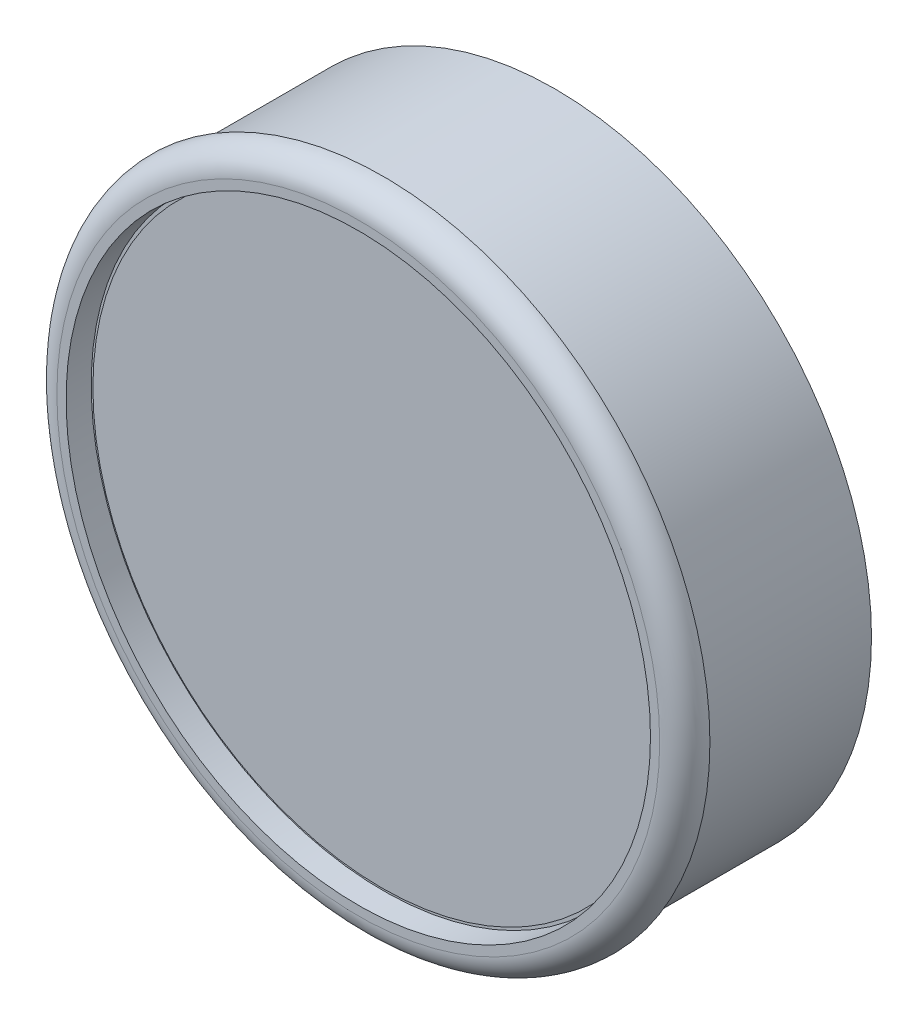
ISO-10303-21;
HEADER;
FILE_DESCRIPTION(('STEP AP214'),'2;1');
FILE_NAME('part.step','',(''),(''),'','','');
FILE_SCHEMA(('AUTOMOTIVE_DESIGN { 1 0 10303 214 1 1 1 1 }'));
ENDSEC;
DATA;
#1=APPLICATION_CONTEXT('core data for automotive mechanical design processes');
#2=APPLICATION_PROTOCOL_DEFINITION('international standard','automotive_design',2000,#1);
#3=PRODUCT_CONTEXT('',#1,'mechanical');
#4=PRODUCT('Part','Part','',(#3));
#5=PRODUCT_RELATED_PRODUCT_CATEGORY('part','',(#4));
#6=PRODUCT_DEFINITION_FORMATION('','',#4);
#7=PRODUCT_DEFINITION_CONTEXT('part definition',#1,'design');
#8=PRODUCT_DEFINITION('design','',#6,#7);
#9=PRODUCT_DEFINITION_SHAPE('','',#8);
#10=(LENGTH_UNIT() NAMED_UNIT(*) SI_UNIT(.MILLI.,.METRE.));
#11=(NAMED_UNIT(*) PLANE_ANGLE_UNIT() SI_UNIT($,.RADIAN.));
#12=(NAMED_UNIT(*) SI_UNIT($,.STERADIAN.) SOLID_ANGLE_UNIT());
#13=UNCERTAINTY_MEASURE_WITH_UNIT(LENGTH_MEASURE(1.E-05),#10,'distance_accuracy_value','');
#14=(GEOMETRIC_REPRESENTATION_CONTEXT(3) GLOBAL_UNCERTAINTY_ASSIGNED_CONTEXT((#13)) GLOBAL_UNIT_ASSIGNED_CONTEXT((#10,
#11,#12)) REPRESENTATION_CONTEXT('',''));
#15=CARTESIAN_POINT('',(0.,0.,0.));
#16=DIRECTION('',(0.,0.,1.));
#17=DIRECTION('',(1.,0.,0.));
#18=AXIS2_PLACEMENT_3D('',#15,#16,#17);
#19=CARTESIAN_POINT('',(0.,0.,20.5));
#20=DIRECTION('',(0.,0.,1.));
#21=DIRECTION('',(1.,0.,0.));
#22=AXIS2_PLACEMENT_3D('',#19,#20,#21);
#23=PLANE('',#22);
#24=CARTESIAN_POINT('',(0.,0.,20.5));
#25=DIRECTION('',(0.,0.,1.));
#26=DIRECTION('',(1.,0.,0.));
#27=AXIS2_PLACEMENT_3D('',#24,#25,#26);
#28=CIRCLE('',#27,34.9);
#29=CARTESIAN_POINT('',(34.9,0.,20.5));
#30=VERTEX_POINT('',#29);
#31=EDGE_CURVE('E38',#30,#30,#28,.T.);
#32=ORIENTED_EDGE('',*,*,#31,.T.);
#33=EDGE_LOOP('',(#32));
#34=FACE_BOUND('',#33,.T.);
#35=CARTESIAN_POINT('',(0.,0.,20.5));
#36=DIRECTION('',(0.,0.,1.));
#37=DIRECTION('',(1.,0.,0.));
#38=AXIS2_PLACEMENT_3D('',#35,#36,#37);
#39=CIRCLE('',#38,34.5);
#40=CARTESIAN_POINT('',(34.5,0.,20.5));
#41=VERTEX_POINT('',#40);
#42=EDGE_CURVE('E47',#41,#41,#39,.T.);
#43=ORIENTED_EDGE('',*,*,#42,.F.);
#44=EDGE_LOOP('',(#43));
#45=FACE_BOUND('',#44,.T.);
#46=ADVANCED_FACE('F12',(#34,#45),#23,.T.);
#47=CARTESIAN_POINT('',(0.,0.,20.5));
#48=DIRECTION('',(0.,0.,-1.));
#49=DIRECTION('',(-1.,0.,0.));
#50=AXIS2_PLACEMENT_3D('',#47,#48,#49);
#51=CYLINDRICAL_SURFACE('',#50,37.8);
#52=CARTESIAN_POINT('',(0.,0.,20.5));
#53=DIRECTION('',(0.,0.,1.));
#54=DIRECTION('',(1.,0.,0.));
#55=AXIS2_PLACEMENT_3D('',#52,#53,#54);
#56=CIRCLE('',#55,37.8);
#57=CARTESIAN_POINT('',(37.8,0.,20.5));
#58=VERTEX_POINT('',#57);
#59=EDGE_CURVE('E27',#58,#58,#56,.T.);
#60=ORIENTED_EDGE('',*,*,#59,.F.);
#61=EDGE_LOOP('',(#60));
#62=FACE_BOUND('',#61,.T.);
#63=CARTESIAN_POINT('',(0.,0.,0.));
#64=DIRECTION('',(0.,0.,1.));
#65=DIRECTION('',(1.,0.,0.));
#66=AXIS2_PLACEMENT_3D('',#63,#64,#65);
#67=CIRCLE('',#66,37.8);
#68=CARTESIAN_POINT('',(37.8,0.,0.));
#69=VERTEX_POINT('',#68);
#70=EDGE_CURVE('E32',#69,#69,#67,.T.);
#71=ORIENTED_EDGE('',*,*,#70,.T.);
#72=EDGE_LOOP('',(#71));
#73=FACE_BOUND('',#72,.T.);
#74=ADVANCED_FACE('F14',(#62,#73),#51,.T.);
#75=CARTESIAN_POINT('',(0.,0.,0.));
#76=DIRECTION('',(0.,0.,1.));
#77=DIRECTION('',(1.,0.,0.));
#78=AXIS2_PLACEMENT_3D('',#75,#76,#77);
#79=PLANE('',#78);
#80=CARTESIAN_POINT('',(0.,0.,0.));
#81=DIRECTION('',(0.,0.,-1.));
#82=DIRECTION('',(-1.,0.,0.));
#83=AXIS2_PLACEMENT_3D('',#80,#81,#82);
#84=CIRCLE('',#83,35.3);
#85=CARTESIAN_POINT('',(-35.3,0.,0.));
#86=VERTEX_POINT('',#85);
#87=EDGE_CURVE('E50',#86,#86,#84,.T.);
#88=ORIENTED_EDGE('',*,*,#87,.F.);
#89=EDGE_LOOP('',(#88));
#90=FACE_BOUND('',#89,.T.);
#91=ORIENTED_EDGE('',*,*,#70,.F.);
#92=EDGE_LOOP('',(#91));
#93=FACE_BOUND('',#92,.T.);
#94=ADVANCED_FACE('F56',(#90,#93),#79,.F.);
#95=CARTESIAN_POINT('',(0.,0.,20.5));
#96=DIRECTION('',(0.,0.,1.));
#97=DIRECTION('',(1.,0.,0.));
#98=AXIS2_PLACEMENT_3D('',#95,#96,#97);
#99=PLANE('',#98);
#100=CARTESIAN_POINT('',(0.,0.,20.5));
#101=DIRECTION('',(0.,0.,1.));
#102=DIRECTION('',(1.,0.,0.));
#103=AXIS2_PLACEMENT_3D('',#100,#101,#102);
#104=CIRCLE('',#103,39.);
#105=CARTESIAN_POINT('',(39.,0.,20.5));
#106=VERTEX_POINT('',#105);
#107=EDGE_CURVE('E35',#106,#106,#104,.T.);
#108=ORIENTED_EDGE('',*,*,#107,.F.);
#109=EDGE_LOOP('',(#108));
#110=FACE_BOUND('',#109,.T.);
#111=ORIENTED_EDGE('',*,*,#59,.T.);
#112=EDGE_LOOP('',(#111));
#113=FACE_BOUND('',#112,.T.);
#114=ADVANCED_FACE('F59',(#110,#113),#99,.F.);
#115=CARTESIAN_POINT('',(0.,0.,23.5));
#116=DIRECTION('',(0.,0.,1.));
#117=DIRECTION('',(1.,0.,0.));
#118=AXIS2_PLACEMENT_3D('',#115,#116,#117);
#119=PLANE('',#118);
#120=CARTESIAN_POINT('',(0.,0.,23.5));
#121=DIRECTION('',(0.,0.,1.));
#122=DIRECTION('',(1.,0.,0.));
#123=AXIS2_PLACEMENT_3D('',#120,#121,#122);
#124=CIRCLE('',#123,34.9);
#125=CARTESIAN_POINT('',(34.9,0.,23.5));
#126=VERTEX_POINT('',#125);
#127=EDGE_CURVE('E41',#126,#126,#124,.T.);
#128=ORIENTED_EDGE('',*,*,#127,.F.);
#129=EDGE_LOOP('',(#128));
#130=FACE_BOUND('',#129,.T.);
#131=CARTESIAN_POINT('',(0.,0.,23.5));
#132=DIRECTION('',(0.,0.,1.));
#133=DIRECTION('',(1.,0.,0.));
#134=AXIS2_PLACEMENT_3D('',#131,#132,#133);
#135=CIRCLE('',#134,36.);
#136=CARTESIAN_POINT('',(36.,0.,23.5));
#137=VERTEX_POINT('',#136);
#138=EDGE_CURVE('E23',#137,#137,#135,.T.);
#139=ORIENTED_EDGE('',*,*,#138,.T.);
#140=EDGE_LOOP('',(#139));
#141=FACE_BOUND('',#140,.T.);
#142=ADVANCED_FACE('F74',(#130,#141),#119,.T.);
#143=CARTESIAN_POINT('',(0.,0.,20.5));
#144=DIRECTION('',(0.,0.,1.));
#145=DIRECTION('',(1.,0.,0.));
#146=AXIS2_PLACEMENT_3D('',#143,#144,#145);
#147=TOROIDAL_SURFACE('',#146,36.,3.);
#148=ORIENTED_EDGE('',*,*,#107,.T.);
#149=EDGE_LOOP('',(#148));
#150=FACE_BOUND('',#149,.T.);
#151=ORIENTED_EDGE('',*,*,#138,.F.);
#152=EDGE_LOOP('',(#151));
#153=FACE_BOUND('',#152,.T.);
#154=ADVANCED_FACE('F81',(#150,#153),#147,.T.);
#155=CARTESIAN_POINT('',(0.,0.,20.5));
#156=DIRECTION('',(0.,0.,1.));
#157=DIRECTION('',(1.,0.,0.));
#158=AXIS2_PLACEMENT_3D('',#155,#156,#157);
#159=CYLINDRICAL_SURFACE('',#158,34.9);
#160=ORIENTED_EDGE('',*,*,#31,.F.);
#161=EDGE_LOOP('',(#160));
#162=FACE_BOUND('',#161,.T.);
#163=ORIENTED_EDGE('',*,*,#127,.T.);
#164=EDGE_LOOP('',(#163));
#165=FACE_BOUND('',#164,.T.);
#166=ADVANCED_FACE('F88',(#162,#165),#159,.F.);
#167=CARTESIAN_POINT('',(0.,0.,20.7));
#168=DIRECTION('',(0.,0.,-1.));
#169=DIRECTION('',(-1.,0.,0.));
#170=AXIS2_PLACEMENT_3D('',#167,#168,#169);
#171=CYLINDRICAL_SURFACE('',#170,34.5);
#172=CARTESIAN_POINT('',(0.,0.,20.7));
#173=DIRECTION('',(0.,0.,1.));
#174=DIRECTION('',(1.,0.,0.));
#175=AXIS2_PLACEMENT_3D('',#172,#173,#174);
#176=CIRCLE('',#175,34.5);
#177=CARTESIAN_POINT('',(34.5,0.,20.7));
#178=VERTEX_POINT('',#177);
#179=EDGE_CURVE('E44',#178,#178,#176,.T.);
#180=ORIENTED_EDGE('',*,*,#179,.F.);
#181=EDGE_LOOP('',(#180));
#182=FACE_BOUND('',#181,.T.);
#183=ORIENTED_EDGE('',*,*,#42,.T.);
#184=EDGE_LOOP('',(#183));
#185=FACE_BOUND('',#184,.T.);
#186=ADVANCED_FACE('F91',(#182,#185),#171,.T.);
#187=CARTESIAN_POINT('',(0.,0.,20.7));
#188=DIRECTION('',(0.,0.,1.));
#189=DIRECTION('',(1.,0.,0.));
#190=AXIS2_PLACEMENT_3D('',#187,#188,#189);
#191=PLANE('',#190);
#192=ORIENTED_EDGE('',*,*,#179,.T.);
#193=EDGE_LOOP('',(#192));
#194=FACE_BOUND('',#193,.T.);
#195=ADVANCED_FACE('F96',(#194),#191,.T.);
#196=CARTESIAN_POINT('',(0.,0.,18.));
#197=DIRECTION('',(0.,0.,-1.));
#198=DIRECTION('',(-1.,0.,0.));
#199=AXIS2_PLACEMENT_3D('',#196,#197,#198);
#200=CYLINDRICAL_SURFACE('',#199,35.3);
#201=CARTESIAN_POINT('',(0.,0.,16.));
#202=DIRECTION('',(0.,0.,-1.));
#203=DIRECTION('',(-1.,0.,0.));
#204=AXIS2_PLACEMENT_3D('',#201,#202,#203);
#205=CIRCLE('',#204,35.3);
#206=CARTESIAN_POINT('',(-35.3,0.,16.));
#207=VERTEX_POINT('',#206);
#208=EDGE_CURVE('E8',#207,#207,#205,.F.);
#209=ORIENTED_EDGE('',*,*,#208,.T.);
#210=EDGE_LOOP('',(#209));
#211=FACE_BOUND('',#210,.T.);
#212=ORIENTED_EDGE('',*,*,#87,.T.);
#213=EDGE_LOOP('',(#212));
#214=FACE_BOUND('',#213,.T.);
#215=ADVANCED_FACE('F54',(#211,#214),#200,.F.);
#216=CARTESIAN_POINT('',(0.,0.,18.));
#217=DIRECTION('',(0.,0.,-1.));
#218=DIRECTION('',(-1.,0.,0.));
#219=AXIS2_PLACEMENT_3D('',#216,#217,#218);
#220=PLANE('',#219);
#221=CARTESIAN_POINT('',(0.,0.,18.));
#222=DIRECTION('',(0.,0.,-1.));
#223=DIRECTION('',(-1.,0.,0.));
#224=AXIS2_PLACEMENT_3D('',#221,#222,#223);
#225=CIRCLE('',#224,33.3);
#226=CARTESIAN_POINT('',(-33.3,0.,18.));
#227=VERTEX_POINT('',#226);
#228=EDGE_CURVE('E19',#227,#227,#225,.T.);
#229=ORIENTED_EDGE('',*,*,#228,.T.);
#230=EDGE_LOOP('',(#229));
#231=FACE_BOUND('',#230,.T.);
#232=ADVANCED_FACE('F103',(#231),#220,.T.);
#233=CARTESIAN_POINT('',(0.,0.,16.));
#234=DIRECTION('',(0.,0.,-1.));
#235=DIRECTION('',(-1.,0.,0.));
#236=AXIS2_PLACEMENT_3D('',#233,#234,#235);
#237=TOROIDAL_SURFACE('',#236,33.3,2.);
#238=ORIENTED_EDGE('',*,*,#208,.F.);
#239=EDGE_LOOP('',(#238));
#240=FACE_BOUND('',#239,.T.);
#241=ORIENTED_EDGE('',*,*,#228,.F.);
#242=EDGE_LOOP('',(#241));
#243=FACE_BOUND('',#242,.T.);
#244=ADVANCED_FACE('F106',(#240,#243),#237,.F.);
#245=CLOSED_SHELL('',(#46,#74,#94,#114,#142,#154,#166,#186,#195,#215,#232,#244));
#246=MANIFOLD_SOLID_BREP('B1',#245);
#247=ADVANCED_BREP_SHAPE_REPRESENTATION('',(#18,#246),#14);
#248=SHAPE_DEFINITION_REPRESENTATION(#9,#247);
ENDSEC;
END-ISO-10303-21;
